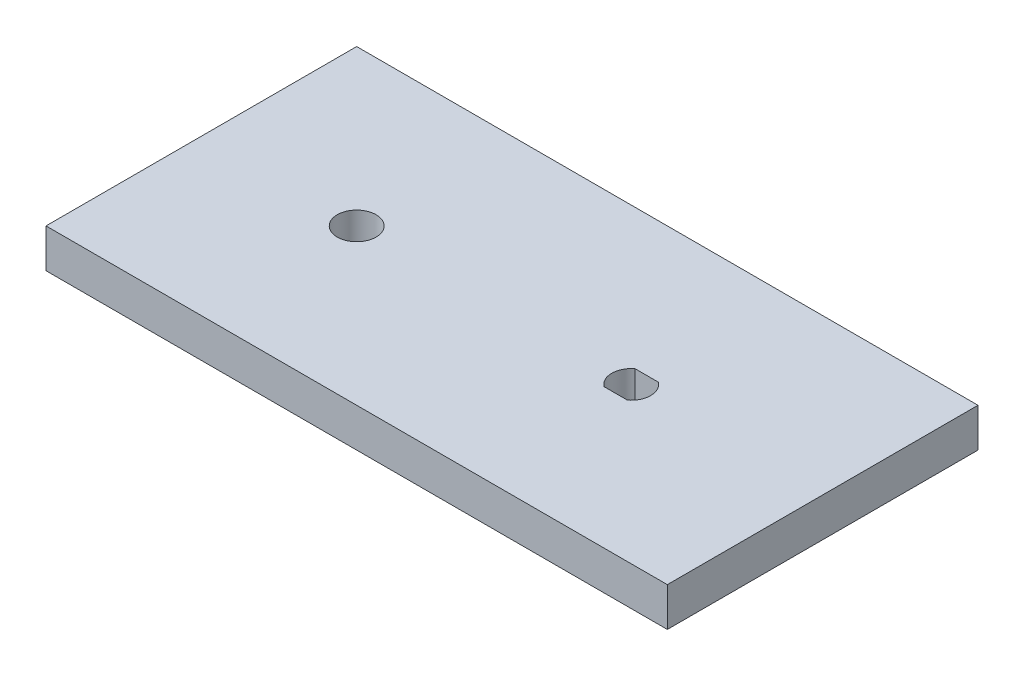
from build123d import *

# Parameters (mm, degrees)
SKETCH_1_W          = 160
SKETCH_1_H          = 80
EXTRUDE_1_DEPTH     = 10
SKETCH_2_R          = 5
CUT_EXTRUDE_1_DEPTH = 180.164728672
CUT_EXTRUDE_2_DEPTH = 180.164728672


with BuildPart() as part:
    # Sketch 1 → Extrude 1 (new body)
    with BuildSketch(Plane(origin=(0, 0, 0), x_dir=(1, 0, 0), z_dir=(0, 1, 0))):
        with Locations((80, 40)):
            Rectangle(SKETCH_1_W, SKETCH_1_H)
    extrude(amount=EXTRUDE_1_DEPTH)

    # Sketch 2 → Cut-Extrude 1 (cut, through all)
    with BuildSketch(Plane(origin=(0, 10, 0), x_dir=(1, 0, 0), z_dir=(0, 1, 0))):
        with Locations(Location((40, 40, 0), (0, 0, 270))):
            Circle(SKETCH_2_R)
    extrude(amount=-CUT_EXTRUDE_1_DEPTH, mode=Mode.SUBTRACT)

    # Sketch 3 → Cut-Extrude 2 (cut, through all)
    with BuildSketch(Plane(origin=(0, 10, 0), x_dir=(1, 0, 0), z_dir=(0, 1, 0))):
        with BuildLine():
            Line((107.7, 44), (113.7, 44))
            ThreePointArc((113.7, 44), (115.7, 40), (113.7, 36))
            Line((113.7, 36), (107.7, 36))
            ThreePointArc((107.7, 36), (105.7, 40), (107.7, 44))
        make_face()
    extrude(amount=-CUT_EXTRUDE_2_DEPTH, mode=Mode.SUBTRACT)


solid = part.part
